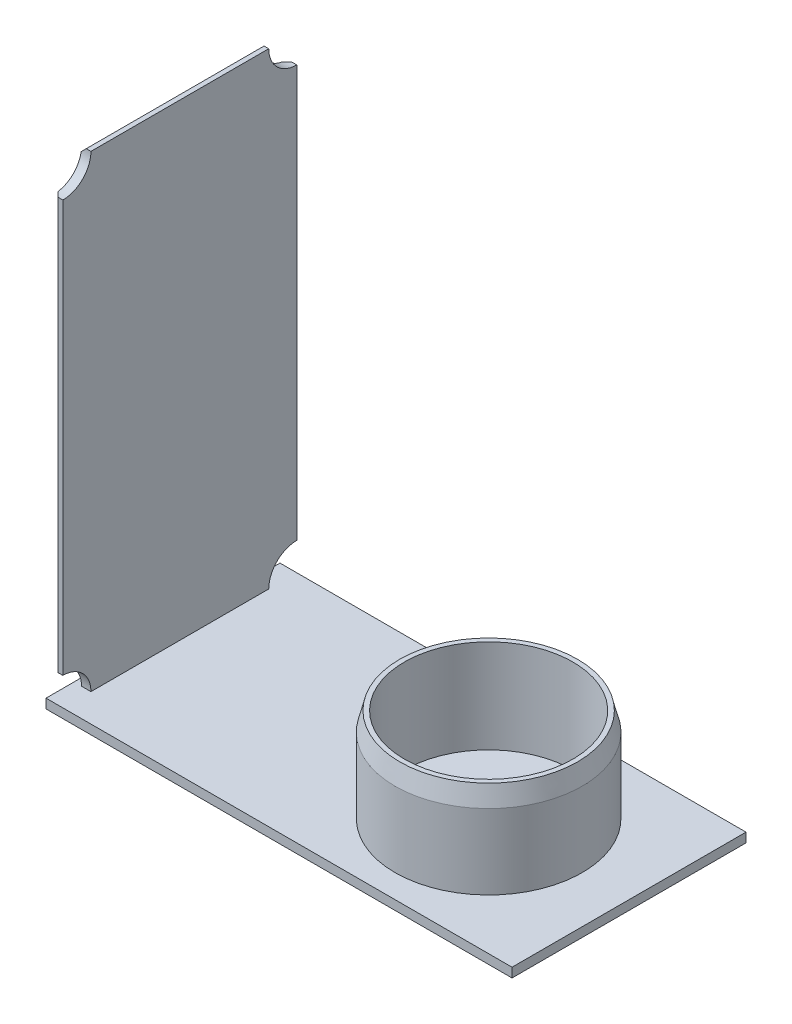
ISO-10303-21;
HEADER;
FILE_DESCRIPTION(('STEP AP214'),'2;1');
FILE_NAME('part.step','',(''),(''),'','','');
FILE_SCHEMA(('AUTOMOTIVE_DESIGN { 1 0 10303 214 1 1 1 1 }'));
ENDSEC;
DATA;
#1=APPLICATION_CONTEXT('core data for automotive mechanical design processes');
#2=APPLICATION_PROTOCOL_DEFINITION('international standard','automotive_design',2000,#1);
#3=PRODUCT_CONTEXT('',#1,'mechanical');
#4=PRODUCT('Part','Part','',(#3));
#5=PRODUCT_RELATED_PRODUCT_CATEGORY('part','',(#4));
#6=PRODUCT_DEFINITION_FORMATION('','',#4);
#7=PRODUCT_DEFINITION_CONTEXT('part definition',#1,'design');
#8=PRODUCT_DEFINITION('design','',#6,#7);
#9=PRODUCT_DEFINITION_SHAPE('','',#8);
#10=(LENGTH_UNIT() NAMED_UNIT(*) SI_UNIT(.MILLI.,.METRE.));
#11=(NAMED_UNIT(*) PLANE_ANGLE_UNIT() SI_UNIT($,.RADIAN.));
#12=(NAMED_UNIT(*) SI_UNIT($,.STERADIAN.) SOLID_ANGLE_UNIT());
#13=UNCERTAINTY_MEASURE_WITH_UNIT(LENGTH_MEASURE(1.E-05),#10,'distance_accuracy_value','');
#14=(GEOMETRIC_REPRESENTATION_CONTEXT(3) GLOBAL_UNCERTAINTY_ASSIGNED_CONTEXT((#13)) GLOBAL_UNIT_ASSIGNED_CONTEXT((#10,
#11,#12)) REPRESENTATION_CONTEXT('',''));
#15=CARTESIAN_POINT('',(0.,0.,0.));
#16=DIRECTION('',(0.,0.,1.));
#17=DIRECTION('',(1.,0.,0.));
#18=AXIS2_PLACEMENT_3D('',#15,#16,#17);
#19=CARTESIAN_POINT('',(-250.,-5.,-125.));
#20=DIRECTION('',(0.,-1.,0.));
#21=DIRECTION('',(0.,0.,-1.));
#22=AXIS2_PLACEMENT_3D('',#19,#20,#21);
#23=PLANE('',#22);
#24=DIRECTION('',(1.,0.,0.));
#25=VECTOR('',#24,1.);
#26=CARTESIAN_POINT('',(-250.,-5.,125.));
#27=LINE('',#26,#25);
#28=CARTESIAN_POINT('',(-248.,-5.,125.));
#29=VERTEX_POINT('',#28);
#30=CARTESIAN_POINT('',(250.,-5.,125.));
#31=VERTEX_POINT('',#30);
#32=EDGE_CURVE('E148',#29,#31,#27,.T.);
#33=ORIENTED_EDGE('',*,*,#32,.F.);
#34=DIRECTION('',(0.,0.,1.));
#35=VECTOR('',#34,1.);
#36=CARTESIAN_POINT('',(-248.,-5.,-125.));
#37=LINE('',#36,#35);
#38=CARTESIAN_POINT('',(-248.,-5.,-125.));
#39=VERTEX_POINT('',#38);
#40=EDGE_CURVE('E136',#39,#29,#37,.T.);
#41=ORIENTED_EDGE('',*,*,#40,.F.);
#42=DIRECTION('',(-1.,0.,0.));
#43=VECTOR('',#42,1.);
#44=CARTESIAN_POINT('',(-250.,-5.,-125.));
#45=LINE('',#44,#43);
#46=CARTESIAN_POINT('',(250.,-5.,-125.));
#47=VERTEX_POINT('',#46);
#48=EDGE_CURVE('E147',#47,#39,#45,.T.);
#49=ORIENTED_EDGE('',*,*,#48,.F.);
#50=DIRECTION('',(0.,0.,-1.));
#51=VECTOR('',#50,1.);
#52=CARTESIAN_POINT('',(250.,-5.,125.));
#53=LINE('',#52,#51);
#54=EDGE_CURVE('E155',#31,#47,#53,.T.);
#55=ORIENTED_EDGE('',*,*,#54,.F.);
#56=EDGE_LOOP('',(#33,#41,#49,#55));
#57=FACE_BOUND('',#56,.T.);
#58=ADVANCED_FACE('F27',(#57),#23,.T.);
#59=CARTESIAN_POINT('',(-250.,5.,-125.));
#60=DIRECTION('',(0.,0.,1.));
#61=DIRECTION('',(1.,0.,0.));
#62=AXIS2_PLACEMENT_3D('',#59,#60,#61);
#63=PLANE('',#62);
#64=DIRECTION('',(0.,-1.,0.));
#65=VECTOR('',#64,1.);
#66=CARTESIAN_POINT('',(-248.,5.,-125.));
#67=LINE('',#66,#65);
#68=CARTESIAN_POINT('',(-248.,5.,-125.));
#69=VERTEX_POINT('',#68);
#70=EDGE_CURVE('E133',#69,#39,#67,.T.);
#71=ORIENTED_EDGE('',*,*,#70,.F.);
#72=DIRECTION('',(-1.,0.,0.));
#73=VECTOR('',#72,1.);
#74=CARTESIAN_POINT('',(-250.,5.,-125.));
#75=LINE('',#74,#73);
#76=CARTESIAN_POINT('',(250.,5.,-125.));
#77=VERTEX_POINT('',#76);
#78=EDGE_CURVE('E163',#77,#69,#75,.T.);
#79=ORIENTED_EDGE('',*,*,#78,.F.);
#80=DIRECTION('',(0.,-1.,0.));
#81=VECTOR('',#80,1.);
#82=CARTESIAN_POINT('',(250.,5.,-125.));
#83=LINE('',#82,#81);
#84=EDGE_CURVE('E153',#77,#47,#83,.T.);
#85=ORIENTED_EDGE('',*,*,#84,.T.);
#86=ORIENTED_EDGE('',*,*,#48,.T.);
#87=EDGE_LOOP('',(#71,#79,#85,#86));
#88=FACE_BOUND('',#87,.T.);
#89=ADVANCED_FACE('F151',(#88),#63,.F.);
#90=CARTESIAN_POINT('',(-250.,5.,125.));
#91=DIRECTION('',(0.,0.,-1.));
#92=DIRECTION('',(-1.,0.,0.));
#93=AXIS2_PLACEMENT_3D('',#90,#91,#92);
#94=PLANE('',#93);
#95=DIRECTION('',(0.,1.,0.));
#96=VECTOR('',#95,1.);
#97=CARTESIAN_POINT('',(-248.,-5.,125.));
#98=LINE('',#97,#96);
#99=CARTESIAN_POINT('',(-248.,5.,125.));
#100=VERTEX_POINT('',#99);
#101=EDGE_CURVE('E42',#29,#100,#98,.T.);
#102=ORIENTED_EDGE('',*,*,#101,.F.);
#103=ORIENTED_EDGE('',*,*,#32,.T.);
#104=DIRECTION('',(0.,-1.,0.));
#105=VECTOR('',#104,1.);
#106=CARTESIAN_POINT('',(250.,5.,125.));
#107=LINE('',#106,#105);
#108=CARTESIAN_POINT('',(250.,5.,125.));
#109=VERTEX_POINT('',#108);
#110=EDGE_CURVE('E166',#109,#31,#107,.T.);
#111=ORIENTED_EDGE('',*,*,#110,.F.);
#112=DIRECTION('',(1.,0.,0.));
#113=VECTOR('',#112,1.);
#114=CARTESIAN_POINT('',(-250.,5.,125.));
#115=LINE('',#114,#113);
#116=EDGE_CURVE('E154',#100,#109,#115,.T.);
#117=ORIENTED_EDGE('',*,*,#116,.F.);
#118=EDGE_LOOP('',(#102,#103,#111,#117));
#119=FACE_BOUND('',#118,.T.);
#120=ADVANCED_FACE('F235',(#119),#94,.F.);
#121=CARTESIAN_POINT('',(-250.,5.,-125.));
#122=DIRECTION('',(0.,-1.,0.));
#123=DIRECTION('',(0.,0.,-1.));
#124=AXIS2_PLACEMENT_3D('',#121,#122,#123);
#125=PLANE('',#124);
#126=CARTESIAN_POINT('',(100.,5.,0.));
#127=DIRECTION('',(0.,1.,0.));
#128=DIRECTION('',(0.,0.,1.));
#129=AXIS2_PLACEMENT_3D('',#126,#127,#128);
#130=CIRCLE('',#129,100.);
#131=CARTESIAN_POINT('',(100.,5.,100.));
#132=VERTEX_POINT('',#131);
#133=EDGE_CURVE('E184',#132,#132,#130,.T.);
#134=ORIENTED_EDGE('',*,*,#133,.F.);
#135=EDGE_LOOP('',(#134));
#136=FACE_BOUND('',#135,.T.);
#137=DIRECTION('',(0.,0.,1.));
#138=VECTOR('',#137,1.);
#139=CARTESIAN_POINT('',(-230.,5.,-125.));
#140=LINE('',#139,#138);
#141=CARTESIAN_POINT('',(-230.,5.,-95.));
#142=VERTEX_POINT('',#141);
#143=CARTESIAN_POINT('',(-230.,5.,95.));
#144=VERTEX_POINT('',#143);
#145=EDGE_CURVE('E172',#142,#144,#140,.T.);
#146=ORIENTED_EDGE('',*,*,#145,.T.);
#147=DIRECTION('',(-1.,0.,0.));
#148=VECTOR('',#147,1.);
#149=CARTESIAN_POINT('',(-230.,4.99999999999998,95.));
#150=LINE('',#149,#148);
#151=CARTESIAN_POINT('',(-240.,5.,95.));
#152=VERTEX_POINT('',#151);
#153=EDGE_CURVE('E177',#144,#152,#150,.T.);
#154=ORIENTED_EDGE('',*,*,#153,.T.);
#155=DIRECTION('',(0.,0.,1.));
#156=VECTOR('',#155,1.);
#157=CARTESIAN_POINT('',(-240.,5.,-125.));
#158=LINE('',#157,#156);
#159=CARTESIAN_POINT('',(-240.,5.,-95.));
#160=VERTEX_POINT('',#159);
#161=EDGE_CURVE('E174',#160,#152,#158,.T.);
#162=ORIENTED_EDGE('',*,*,#161,.F.);
#163=DIRECTION('',(-1.,0.,0.));
#164=VECTOR('',#163,1.);
#165=CARTESIAN_POINT('',(-230.,5.,-95.));
#166=LINE('',#165,#164);
#167=EDGE_CURVE('E169',#142,#160,#166,.T.);
#168=ORIENTED_EDGE('',*,*,#167,.F.);
#169=EDGE_LOOP('',(#146,#154,#162,#168));
#170=FACE_BOUND('',#169,.T.);
#171=DIRECTION('',(0.,0.,-1.));
#172=VECTOR('',#171,1.);
#173=CARTESIAN_POINT('',(-248.,5.,125.));
#174=LINE('',#173,#172);
#175=EDGE_CURVE('E137',#100,#69,#174,.T.);
#176=ORIENTED_EDGE('',*,*,#175,.F.);
#177=ORIENTED_EDGE('',*,*,#116,.T.);
#178=DIRECTION('',(0.,0.,-1.));
#179=VECTOR('',#178,1.);
#180=CARTESIAN_POINT('',(250.,5.,125.));
#181=LINE('',#180,#179);
#182=EDGE_CURVE('E157',#109,#77,#181,.T.);
#183=ORIENTED_EDGE('',*,*,#182,.T.);
#184=ORIENTED_EDGE('',*,*,#78,.T.);
#185=EDGE_LOOP('',(#176,#177,#183,#184));
#186=FACE_BOUND('',#185,.T.);
#187=ADVANCED_FACE('F246',(#136,#170,#186),#125,.F.);
#188=CARTESIAN_POINT('',(100.,105.,0.));
#189=DIRECTION('',(0.,1.,0.));
#190=DIRECTION('',(0.,0.,1.));
#191=AXIS2_PLACEMENT_3D('',#188,#189,#190);
#192=PLANE('',#191);
#193=CARTESIAN_POINT('',(100.,105.,0.));
#194=DIRECTION('',(0.,1.,0.));
#195=DIRECTION('',(0.,0.,1.));
#196=AXIS2_PLACEMENT_3D('',#193,#194,#195);
#197=CIRCLE('',#196,94.9999999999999);
#198=CARTESIAN_POINT('',(100.,105.,94.9999999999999));
#199=VERTEX_POINT('',#198);
#200=EDGE_CURVE('E35',#199,#199,#197,.T.);
#201=ORIENTED_EDGE('',*,*,#200,.T.);
#202=EDGE_LOOP('',(#201));
#203=FACE_BOUND('',#202,.T.);
#204=CARTESIAN_POINT('',(100.,105.,0.));
#205=DIRECTION('',(0.,1.,0.));
#206=DIRECTION('',(0.,0.,1.));
#207=AXIS2_PLACEMENT_3D('',#204,#205,#206);
#208=CIRCLE('',#207,90.);
#209=CARTESIAN_POINT('',(100.,105.,90.));
#210=VERTEX_POINT('',#209);
#211=EDGE_CURVE('E181',#210,#210,#208,.T.);
#212=ORIENTED_EDGE('',*,*,#211,.F.);
#213=EDGE_LOOP('',(#212));
#214=FACE_BOUND('',#213,.T.);
#215=ADVANCED_FACE('F215',(#203,#214),#192,.T.);
#216=CARTESIAN_POINT('',(100.,105.,0.));
#217=DIRECTION('',(0.,-1.,0.));
#218=DIRECTION('',(0.,0.,-1.));
#219=AXIS2_PLACEMENT_3D('',#216,#217,#218);
#220=CYLINDRICAL_SURFACE('',#219,100.);
#221=CARTESIAN_POINT('',(100.,84.9999999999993,0.));
#222=DIRECTION('',(0.,1.,0.));
#223=DIRECTION('',(0.,0.,1.));
#224=AXIS2_PLACEMENT_3D('',#221,#222,#223);
#225=CIRCLE('',#224,100.);
#226=CARTESIAN_POINT('',(100.,84.9999999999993,100.));
#227=VERTEX_POINT('',#226);
#228=EDGE_CURVE('E11',#227,#227,#225,.F.);
#229=ORIENTED_EDGE('',*,*,#228,.T.);
#230=EDGE_LOOP('',(#229));
#231=FACE_BOUND('',#230,.T.);
#232=ORIENTED_EDGE('',*,*,#133,.T.);
#233=EDGE_LOOP('',(#232));
#234=FACE_BOUND('',#233,.T.);
#235=ADVANCED_FACE('F29',(#231,#234),#220,.T.);
#236=CARTESIAN_POINT('',(100.,105.,0.));
#237=DIRECTION('',(0.,-1.,0.));
#238=DIRECTION('',(0.,0.,-1.));
#239=AXIS2_PLACEMENT_3D('',#236,#237,#238);
#240=CYLINDRICAL_SURFACE('',#239,90.);
#241=ORIENTED_EDGE('',*,*,#211,.T.);
#242=EDGE_LOOP('',(#241));
#243=FACE_BOUND('',#242,.T.);
#244=CARTESIAN_POINT('',(100.,5.,0.));
#245=DIRECTION('',(0.,1.,0.));
#246=DIRECTION('',(0.,0.,1.));
#247=AXIS2_PLACEMENT_3D('',#244,#245,#246);
#248=CIRCLE('',#247,90.);
#249=CARTESIAN_POINT('',(100.,5.,90.));
#250=VERTEX_POINT('',#249);
#251=EDGE_CURVE('E178',#250,#250,#248,.T.);
#252=ORIENTED_EDGE('',*,*,#251,.F.);
#253=EDGE_LOOP('',(#252));
#254=FACE_BOUND('',#253,.T.);
#255=ADVANCED_FACE('F244',(#243,#254),#240,.F.);
#256=ORIENTED_EDGE('',*,*,#251,.T.);
#257=EDGE_LOOP('',(#256));
#258=FACE_BOUND('',#257,.T.);
#259=ADVANCED_FACE('F241',(#258),#125,.F.);
#260=CARTESIAN_POINT('',(-240.,505.,125.));
#261=DIRECTION('',(0.,-1.,0.));
#262=DIRECTION('',(0.,0.,1.));
#263=AXIS2_PLACEMENT_3D('',#260,#261,#262);
#264=PLANE('',#263);
#265=DIRECTION('',(-1.,0.,0.));
#266=VECTOR('',#265,1.);
#267=CARTESIAN_POINT('',(-230.,505.,-94.9999999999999));
#268=LINE('',#267,#266);
#269=CARTESIAN_POINT('',(-230.,505.,-94.9999999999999));
#270=VERTEX_POINT('',#269);
#271=CARTESIAN_POINT('',(-235.,505.,-94.9999999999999));
#272=VERTEX_POINT('',#271);
#273=EDGE_CURVE('E306',#270,#272,#268,.T.);
#274=ORIENTED_EDGE('',*,*,#273,.T.);
#275=DIRECTION('',(0.,0.,1.));
#276=VECTOR('',#275,1.);
#277=CARTESIAN_POINT('',(-235.,505.,125.));
#278=LINE('',#277,#276);
#279=CARTESIAN_POINT('',(-235.,505.,95.0000000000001));
#280=VERTEX_POINT('',#279);
#281=EDGE_CURVE('E211',#272,#280,#278,.T.);
#282=ORIENTED_EDGE('',*,*,#281,.T.);
#283=DIRECTION('',(-1.,0.,0.));
#284=VECTOR('',#283,1.);
#285=CARTESIAN_POINT('',(-230.,505.,95.0000000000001));
#286=LINE('',#285,#284);
#287=CARTESIAN_POINT('',(-230.,505.,95.0000000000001));
#288=VERTEX_POINT('',#287);
#289=EDGE_CURVE('E316',#280,#288,#286,.F.);
#290=ORIENTED_EDGE('',*,*,#289,.T.);
#291=DIRECTION('',(0.,0.,-1.));
#292=VECTOR('',#291,1.);
#293=CARTESIAN_POINT('',(-230.,505.,125.));
#294=LINE('',#293,#292);
#295=EDGE_CURVE('E284',#288,#270,#294,.T.);
#296=ORIENTED_EDGE('',*,*,#295,.T.);
#297=EDGE_LOOP('',(#274,#282,#290,#296));
#298=FACE_BOUND('',#297,.T.);
#299=ADVANCED_FACE('F243',(#298),#264,.F.);
#300=CARTESIAN_POINT('',(-230.,505.,-125.));
#301=DIRECTION('',(-1.,0.,0.));
#302=DIRECTION('',(0.,0.,1.));
#303=AXIS2_PLACEMENT_3D('',#300,#301,#302);
#304=CYLINDRICAL_SURFACE('',#303,30.);
#305=DIRECTION('',(-1.,0.,0.));
#306=VECTOR('',#305,1.);
#307=CARTESIAN_POINT('',(-230.,475.,-125.));
#308=LINE('',#307,#306);
#309=CARTESIAN_POINT('',(-235.,475.,-125.));
#310=VERTEX_POINT('',#309);
#311=CARTESIAN_POINT('',(-230.,475.,-125.));
#312=VERTEX_POINT('',#311);
#313=EDGE_CURVE('E309',#310,#312,#308,.F.);
#314=ORIENTED_EDGE('',*,*,#313,.F.);
#315=CARTESIAN_POINT('',(-235.,505.,-125.));
#316=DIRECTION('',(0.707106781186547,0.,0.707106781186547));
#317=DIRECTION('',(-0.707106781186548,0.,0.707106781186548));
#318=AXIS2_PLACEMENT_3D('',#315,#316,#317);
#319=ELLIPSE('',#318,42.4264068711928,30.);
#320=CARTESIAN_POINT('',(-240.,475.419601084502,-120.));
#321=VERTEX_POINT('',#320);
#322=EDGE_CURVE('E202',#310,#321,#319,.F.);
#323=ORIENTED_EDGE('',*,*,#322,.T.);
#324=CARTESIAN_POINT('',(-240.,505.,-125.));
#325=DIRECTION('',(-1.,0.,0.));
#326=DIRECTION('',(0.,0.,1.));
#327=AXIS2_PLACEMENT_3D('',#324,#325,#326);
#328=CIRCLE('',#327,30.);
#329=CARTESIAN_POINT('',(-240.,500.,-95.4196010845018));
#330=VERTEX_POINT('',#329);
#331=EDGE_CURVE('E311',#321,#330,#328,.T.);
#332=ORIENTED_EDGE('',*,*,#331,.T.);
#333=CARTESIAN_POINT('',(-235.,505.,-125.));
#334=DIRECTION('',(0.707106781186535,-0.70710678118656,0.));
#335=DIRECTION('',(-0.70710678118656,-0.707106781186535,0.));
#336=AXIS2_PLACEMENT_3D('',#333,#334,#335);
#337=ELLIPSE('',#336,42.4264068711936,30.);
#338=EDGE_CURVE('E200',#330,#272,#337,.F.);
#339=ORIENTED_EDGE('',*,*,#338,.T.);
#340=ORIENTED_EDGE('',*,*,#273,.F.);
#341=CARTESIAN_POINT('',(-230.,505.,-125.));
#342=DIRECTION('',(1.,0.,0.));
#343=DIRECTION('',(0.,0.,-1.));
#344=AXIS2_PLACEMENT_3D('',#341,#342,#343);
#345=CIRCLE('',#344,30.);
#346=EDGE_CURVE('E278',#270,#312,#345,.T.);
#347=ORIENTED_EDGE('',*,*,#346,.T.);
#348=EDGE_LOOP('',(#314,#323,#332,#339,#340,#347));
#349=FACE_BOUND('',#348,.T.);
#350=ADVANCED_FACE('F338',(#349),#304,.F.);
#351=CARTESIAN_POINT('',(-240.,5.00000000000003,-125.));
#352=DIRECTION('',(0.,0.,1.));
#353=DIRECTION('',(0.,1.,0.));
#354=AXIS2_PLACEMENT_3D('',#351,#352,#353);
#355=PLANE('',#354);
#356=DIRECTION('',(-1.,0.,0.));
#357=VECTOR('',#356,1.);
#358=CARTESIAN_POINT('',(-230.,35.,-125.));
#359=LINE('',#358,#357);
#360=CARTESIAN_POINT('',(-230.,35.,-125.));
#361=VERTEX_POINT('',#360);
#362=CARTESIAN_POINT('',(-235.,35.,-125.));
#363=VERTEX_POINT('',#362);
#364=EDGE_CURVE('E297',#361,#363,#359,.T.);
#365=ORIENTED_EDGE('',*,*,#364,.T.);
#366=DIRECTION('',(0.,1.,0.));
#367=VECTOR('',#366,1.);
#368=CARTESIAN_POINT('',(-235.,5.00000000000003,-125.));
#369=LINE('',#368,#367);
#370=EDGE_CURVE('E198',#363,#310,#369,.T.);
#371=ORIENTED_EDGE('',*,*,#370,.T.);
#372=ORIENTED_EDGE('',*,*,#313,.T.);
#373=DIRECTION('',(0.,-1.,0.));
#374=VECTOR('',#373,1.);
#375=CARTESIAN_POINT('',(-230.,5.00000000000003,-125.));
#376=LINE('',#375,#374);
#377=EDGE_CURVE('E280',#312,#361,#376,.T.);
#378=ORIENTED_EDGE('',*,*,#377,.T.);
#379=EDGE_LOOP('',(#365,#371,#372,#378));
#380=FACE_BOUND('',#379,.T.);
#381=ADVANCED_FACE('F375',(#380),#355,.F.);
#382=CARTESIAN_POINT('',(-240.,4.99999999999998,125.));
#383=DIRECTION('',(0.,0.,-1.));
#384=DIRECTION('',(0.,-1.,0.));
#385=AXIS2_PLACEMENT_3D('',#382,#383,#384);
#386=PLANE('',#385);
#387=DIRECTION('',(-1.,0.,0.));
#388=VECTOR('',#387,1.);
#389=CARTESIAN_POINT('',(-230.,475.,125.));
#390=LINE('',#389,#388);
#391=CARTESIAN_POINT('',(-230.,475.,125.));
#392=VERTEX_POINT('',#391);
#393=CARTESIAN_POINT('',(-235.,475.,125.));
#394=VERTEX_POINT('',#393);
#395=EDGE_CURVE('E314',#392,#394,#390,.T.);
#396=ORIENTED_EDGE('',*,*,#395,.T.);
#397=DIRECTION('',(0.,-1.,0.));
#398=VECTOR('',#397,1.);
#399=CARTESIAN_POINT('',(-235.,4.99999999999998,125.));
#400=LINE('',#399,#398);
#401=CARTESIAN_POINT('',(-235.,35.,125.));
#402=VERTEX_POINT('',#401);
#403=EDGE_CURVE('E50',#394,#402,#400,.T.);
#404=ORIENTED_EDGE('',*,*,#403,.T.);
#405=DIRECTION('',(-1.,0.,0.));
#406=VECTOR('',#405,1.);
#407=CARTESIAN_POINT('',(-230.,35.,125.));
#408=LINE('',#407,#406);
#409=CARTESIAN_POINT('',(-230.,35.,125.));
#410=VERTEX_POINT('',#409);
#411=EDGE_CURVE('E289',#402,#410,#408,.F.);
#412=ORIENTED_EDGE('',*,*,#411,.T.);
#413=DIRECTION('',(0.,1.,0.));
#414=VECTOR('',#413,1.);
#415=CARTESIAN_POINT('',(-230.,4.99999999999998,125.));
#416=LINE('',#415,#414);
#417=EDGE_CURVE('E286',#410,#392,#416,.T.);
#418=ORIENTED_EDGE('',*,*,#417,.T.);
#419=EDGE_LOOP('',(#396,#404,#412,#418));
#420=FACE_BOUND('',#419,.T.);
#421=ADVANCED_FACE('F239',(#420),#386,.F.);
#422=CARTESIAN_POINT('',(-230.,505.,125.));
#423=DIRECTION('',(-1.,0.,0.));
#424=DIRECTION('',(0.,0.,1.));
#425=AXIS2_PLACEMENT_3D('',#422,#423,#424);
#426=CYLINDRICAL_SURFACE('',#425,30.);
#427=CARTESIAN_POINT('',(-240.,505.,125.));
#428=DIRECTION('',(-1.,0.,0.));
#429=DIRECTION('',(0.,0.,1.));
#430=AXIS2_PLACEMENT_3D('',#427,#428,#429);
#431=CIRCLE('',#430,30.);
#432=CARTESIAN_POINT('',(-240.,500.,95.419601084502));
#433=VERTEX_POINT('',#432);
#434=CARTESIAN_POINT('',(-240.,475.419601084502,120.));
#435=VERTEX_POINT('',#434);
#436=EDGE_CURVE('E275',#433,#435,#431,.T.);
#437=ORIENTED_EDGE('',*,*,#436,.T.);
#438=CARTESIAN_POINT('',(-235.,505.,125.));
#439=DIRECTION('',(0.707106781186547,0.,-0.707106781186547));
#440=DIRECTION('',(-0.707106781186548,0.,-0.707106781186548));
#441=AXIS2_PLACEMENT_3D('',#438,#439,#440);
#442=ELLIPSE('',#441,42.4264068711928,30.);
#443=EDGE_CURVE('E206',#435,#394,#442,.F.);
#444=ORIENTED_EDGE('',*,*,#443,.T.);
#445=ORIENTED_EDGE('',*,*,#395,.F.);
#446=CARTESIAN_POINT('',(-230.,505.,125.));
#447=DIRECTION('',(-1.,0.,0.));
#448=DIRECTION('',(0.,0.,1.));
#449=AXIS2_PLACEMENT_3D('',#446,#447,#448);
#450=CIRCLE('',#449,30.);
#451=EDGE_CURVE('E318',#288,#392,#450,.T.);
#452=ORIENTED_EDGE('',*,*,#451,.F.);
#453=ORIENTED_EDGE('',*,*,#289,.F.);
#454=CARTESIAN_POINT('',(-235.,505.,125.));
#455=DIRECTION('',(0.707106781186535,-0.70710678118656,0.));
#456=DIRECTION('',(-0.70710678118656,-0.707106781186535,0.));
#457=AXIS2_PLACEMENT_3D('',#454,#455,#456);
#458=ELLIPSE('',#457,42.4264068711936,30.);
#459=EDGE_CURVE('E204',#280,#433,#458,.F.);
#460=ORIENTED_EDGE('',*,*,#459,.T.);
#461=EDGE_LOOP('',(#437,#444,#445,#452,#453,#460));
#462=FACE_BOUND('',#461,.T.);
#463=ADVANCED_FACE('F252',(#462),#426,.F.);
#464=CARTESIAN_POINT('',(250.,5.,125.));
#465=DIRECTION('',(-1.,0.,0.));
#466=DIRECTION('',(0.,0.,1.));
#467=AXIS2_PLACEMENT_3D('',#464,#465,#466);
#468=PLANE('',#467);
#469=ORIENTED_EDGE('',*,*,#54,.T.);
#470=ORIENTED_EDGE('',*,*,#84,.F.);
#471=ORIENTED_EDGE('',*,*,#182,.F.);
#472=ORIENTED_EDGE('',*,*,#110,.T.);
#473=EDGE_LOOP('',(#469,#470,#471,#472));
#474=FACE_BOUND('',#473,.T.);
#475=ADVANCED_FACE('F248',(#474),#468,.F.);
#476=CARTESIAN_POINT('',(-230.,5.00000000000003,-125.));
#477=DIRECTION('',(-1.,0.,0.));
#478=DIRECTION('',(0.,0.,1.));
#479=AXIS2_PLACEMENT_3D('',#476,#477,#478);
#480=CYLINDRICAL_SURFACE('',#479,30.);
#481=CARTESIAN_POINT('',(-240.,5.00000000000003,-125.));
#482=DIRECTION('',(-1.,0.,0.));
#483=DIRECTION('',(0.,0.,1.));
#484=AXIS2_PLACEMENT_3D('',#481,#482,#483);
#485=CIRCLE('',#484,30.);
#486=CARTESIAN_POINT('',(-240.,34.5803989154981,-120.));
#487=VERTEX_POINT('',#486);
#488=EDGE_CURVE('E303',#160,#487,#485,.T.);
#489=ORIENTED_EDGE('',*,*,#488,.T.);
#490=CARTESIAN_POINT('',(-235.,5.00000000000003,-125.));
#491=DIRECTION('',(0.707106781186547,0.,0.707106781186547));
#492=DIRECTION('',(-0.707106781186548,0.,0.707106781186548));
#493=AXIS2_PLACEMENT_3D('',#490,#491,#492);
#494=ELLIPSE('',#493,42.4264068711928,30.);
#495=EDGE_CURVE('E196',#487,#363,#494,.F.);
#496=ORIENTED_EDGE('',*,*,#495,.T.);
#497=ORIENTED_EDGE('',*,*,#364,.F.);
#498=CARTESIAN_POINT('',(-230.,5.00000000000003,-125.));
#499=DIRECTION('',(-1.,0.,0.));
#500=DIRECTION('',(0.,0.,1.));
#501=AXIS2_PLACEMENT_3D('',#498,#499,#500);
#502=CIRCLE('',#501,30.);
#503=EDGE_CURVE('E300',#142,#361,#502,.T.);
#504=ORIENTED_EDGE('',*,*,#503,.F.);
#505=ORIENTED_EDGE('',*,*,#167,.T.);
#506=EDGE_LOOP('',(#489,#496,#497,#504,#505));
#507=FACE_BOUND('',#506,.T.);
#508=ADVANCED_FACE('F251',(#507),#480,.F.);
#509=CARTESIAN_POINT('',(-240.,5.00000000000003,-125.));
#510=DIRECTION('',(1.,0.,0.));
#511=DIRECTION('',(0.,0.,-1.));
#512=AXIS2_PLACEMENT_3D('',#509,#510,#511);
#513=PLANE('',#512);
#514=ORIENTED_EDGE('',*,*,#331,.F.);
#515=DIRECTION('',(0.,-1.,0.));
#516=VECTOR('',#515,1.);
#517=CARTESIAN_POINT('',(-240.,5.00000000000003,-120.));
#518=LINE('',#517,#516);
#519=EDGE_CURVE('E193',#321,#487,#518,.T.);
#520=ORIENTED_EDGE('',*,*,#519,.T.);
#521=ORIENTED_EDGE('',*,*,#488,.F.);
#522=ORIENTED_EDGE('',*,*,#161,.T.);
#523=CARTESIAN_POINT('',(-240.,4.99999999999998,125.));
#524=DIRECTION('',(-1.,0.,0.));
#525=DIRECTION('',(0.,0.,1.));
#526=AXIS2_PLACEMENT_3D('',#523,#524,#525);
#527=CIRCLE('',#526,30.);
#528=CARTESIAN_POINT('',(-240.,34.5803989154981,120.));
#529=VERTEX_POINT('',#528);
#530=EDGE_CURVE('E295',#529,#152,#527,.T.);
#531=ORIENTED_EDGE('',*,*,#530,.F.);
#532=DIRECTION('',(0.,1.,0.));
#533=VECTOR('',#532,1.);
#534=CARTESIAN_POINT('',(-240.,4.99999999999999,120.));
#535=LINE('',#534,#533);
#536=EDGE_CURVE('E190',#529,#435,#535,.T.);
#537=ORIENTED_EDGE('',*,*,#536,.T.);
#538=ORIENTED_EDGE('',*,*,#436,.F.);
#539=DIRECTION('',(0.,0.,-1.));
#540=VECTOR('',#539,1.);
#541=CARTESIAN_POINT('',(-240.,500.,-125.));
#542=LINE('',#541,#540);
#543=EDGE_CURVE('E187',#433,#330,#542,.T.);
#544=ORIENTED_EDGE('',*,*,#543,.T.);
#545=EDGE_LOOP('',(#514,#520,#521,#522,#531,#537,#538,#544));
#546=FACE_BOUND('',#545,.T.);
#547=ADVANCED_FACE('F330',(#546),#513,.F.);
#548=CARTESIAN_POINT('',(-230.,4.99999999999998,125.));
#549=DIRECTION('',(-1.,0.,0.));
#550=DIRECTION('',(0.,0.,1.));
#551=AXIS2_PLACEMENT_3D('',#548,#549,#550);
#552=CYLINDRICAL_SURFACE('',#551,30.);
#553=ORIENTED_EDGE('',*,*,#411,.F.);
#554=CARTESIAN_POINT('',(-235.,4.99999999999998,125.));
#555=DIRECTION('',(0.707106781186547,0.,-0.707106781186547));
#556=DIRECTION('',(-0.707106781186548,0.,-0.707106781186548));
#557=AXIS2_PLACEMENT_3D('',#554,#555,#556);
#558=ELLIPSE('',#557,42.4264068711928,30.);
#559=EDGE_CURVE('E209',#402,#529,#558,.F.);
#560=ORIENTED_EDGE('',*,*,#559,.T.);
#561=ORIENTED_EDGE('',*,*,#530,.T.);
#562=ORIENTED_EDGE('',*,*,#153,.F.);
#563=CARTESIAN_POINT('',(-230.,4.99999999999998,125.));
#564=DIRECTION('',(-1.,0.,0.));
#565=DIRECTION('',(0.,0.,1.));
#566=AXIS2_PLACEMENT_3D('',#563,#564,#565);
#567=CIRCLE('',#566,30.);
#568=EDGE_CURVE('E292',#410,#144,#567,.T.);
#569=ORIENTED_EDGE('',*,*,#568,.F.);
#570=EDGE_LOOP('',(#553,#560,#561,#562,#569));
#571=FACE_BOUND('',#570,.T.);
#572=ADVANCED_FACE('F359',(#571),#552,.F.);
#573=CARTESIAN_POINT('',(-230.,5.00000000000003,-125.));
#574=DIRECTION('',(1.,0.,0.));
#575=DIRECTION('',(0.,0.,-1.));
#576=AXIS2_PLACEMENT_3D('',#573,#574,#575);
#577=PLANE('',#576);
#578=ORIENTED_EDGE('',*,*,#451,.T.);
#579=ORIENTED_EDGE('',*,*,#417,.F.);
#580=ORIENTED_EDGE('',*,*,#568,.T.);
#581=ORIENTED_EDGE('',*,*,#145,.F.);
#582=ORIENTED_EDGE('',*,*,#503,.T.);
#583=ORIENTED_EDGE('',*,*,#377,.F.);
#584=ORIENTED_EDGE('',*,*,#346,.F.);
#585=ORIENTED_EDGE('',*,*,#295,.F.);
#586=EDGE_LOOP('',(#578,#579,#580,#581,#582,#583,#584,#585));
#587=FACE_BOUND('',#586,.T.);
#588=ADVANCED_FACE('F344',(#587),#577,.T.);
#589=CARTESIAN_POINT('',(-240.,5.00000000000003,-120.));
#590=DIRECTION('',(0.707106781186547,0.,0.707106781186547));
#591=DIRECTION('',(0.707106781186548,0.,-0.707106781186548));
#592=AXIS2_PLACEMENT_3D('',#589,#590,#591);
#593=PLANE('',#592);
#594=ORIENTED_EDGE('',*,*,#322,.F.);
#595=ORIENTED_EDGE('',*,*,#370,.F.);
#596=ORIENTED_EDGE('',*,*,#495,.F.);
#597=ORIENTED_EDGE('',*,*,#519,.F.);
#598=EDGE_LOOP('',(#594,#595,#596,#597));
#599=FACE_BOUND('',#598,.T.);
#600=ADVANCED_FACE('F352',(#599),#593,.F.);
#601=CARTESIAN_POINT('',(-240.,4.99999999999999,120.));
#602=DIRECTION('',(0.707106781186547,0.,-0.707106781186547));
#603=DIRECTION('',(-0.707106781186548,0.,-0.707106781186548));
#604=AXIS2_PLACEMENT_3D('',#601,#602,#603);
#605=PLANE('',#604);
#606=ORIENTED_EDGE('',*,*,#559,.F.);
#607=ORIENTED_EDGE('',*,*,#403,.F.);
#608=ORIENTED_EDGE('',*,*,#443,.F.);
#609=ORIENTED_EDGE('',*,*,#536,.F.);
#610=EDGE_LOOP('',(#606,#607,#608,#609));
#611=FACE_BOUND('',#610,.T.);
#612=ADVANCED_FACE('F362',(#611),#605,.F.);
#613=CARTESIAN_POINT('',(-240.,500.,-125.));
#614=DIRECTION('',(0.707106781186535,-0.70710678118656,0.));
#615=DIRECTION('',(0.70710678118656,0.707106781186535,0.));
#616=AXIS2_PLACEMENT_3D('',#613,#614,#615);
#617=PLANE('',#616);
#618=ORIENTED_EDGE('',*,*,#459,.F.);
#619=ORIENTED_EDGE('',*,*,#281,.F.);
#620=ORIENTED_EDGE('',*,*,#338,.F.);
#621=ORIENTED_EDGE('',*,*,#543,.F.);
#622=EDGE_LOOP('',(#618,#619,#620,#621));
#623=FACE_BOUND('',#622,.T.);
#624=ADVANCED_FACE('F226',(#623),#617,.F.);
#625=CARTESIAN_POINT('',(-248.,-5.,-125.));
#626=DIRECTION('',(-1.,0.,0.));
#627=DIRECTION('',(0.,0.,1.));
#628=AXIS2_PLACEMENT_3D('',#625,#626,#627);
#629=PLANE('',#628);
#630=ORIENTED_EDGE('',*,*,#70,.T.);
#631=ORIENTED_EDGE('',*,*,#40,.T.);
#632=ORIENTED_EDGE('',*,*,#101,.T.);
#633=ORIENTED_EDGE('',*,*,#175,.T.);
#634=EDGE_LOOP('',(#630,#631,#632,#633));
#635=FACE_BOUND('',#634,.T.);
#636=ADVANCED_FACE('F135',(#635),#629,.T.);
#637=CARTESIAN_POINT('',(100.,105.,0.));
#638=DIRECTION('',(0.,-1.,0.));
#639=DIRECTION('',(0.,0.,-1.));
#640=AXIS2_PLACEMENT_3D('',#637,#638,#639);
#641=CONICAL_SURFACE('',#640,94.9999999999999,0.244978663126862);
#642=ORIENTED_EDGE('',*,*,#228,.F.);
#643=EDGE_LOOP('',(#642));
#644=FACE_BOUND('',#643,.T.);
#645=ORIENTED_EDGE('',*,*,#200,.F.);
#646=EDGE_LOOP('',(#645));
#647=FACE_BOUND('',#646,.T.);
#648=ADVANCED_FACE('F218',(#644,#647),#641,.T.);
#649=CLOSED_SHELL('',(#58,#89,#120,#187,#215,#235,#255,#259,#299,#350,#381,#421,#463,#475,#508,
#547,#572,#588,#600,#612,#624,#636,#648));
#650=MANIFOLD_SOLID_BREP('B2',#649);
#651=ADVANCED_BREP_SHAPE_REPRESENTATION('',(#18,#650),#14);
#652=SHAPE_DEFINITION_REPRESENTATION(#9,#651);
ENDSEC;
END-ISO-10303-21;
